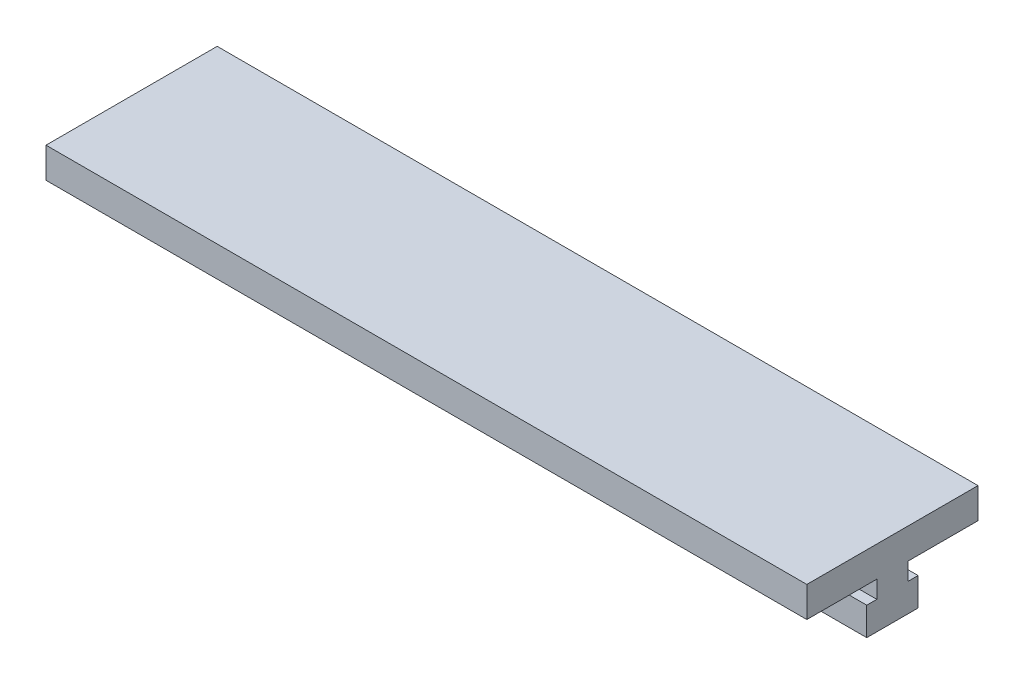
ISO-10303-21;
HEADER;
FILE_DESCRIPTION(('STEP AP214'),'2;1');
FILE_NAME('part.step','',(''),(''),'','','');
FILE_SCHEMA(('AUTOMOTIVE_DESIGN { 1 0 10303 214 1 1 1 1 }'));
ENDSEC;
DATA;
#1=APPLICATION_CONTEXT('core data for automotive mechanical design processes');
#2=APPLICATION_PROTOCOL_DEFINITION('international standard','automotive_design',2000,#1);
#3=PRODUCT_CONTEXT('',#1,'mechanical');
#4=PRODUCT('Part','Part','',(#3));
#5=PRODUCT_RELATED_PRODUCT_CATEGORY('part','',(#4));
#6=PRODUCT_DEFINITION_FORMATION('','',#4);
#7=PRODUCT_DEFINITION_CONTEXT('part definition',#1,'design');
#8=PRODUCT_DEFINITION('design','',#6,#7);
#9=PRODUCT_DEFINITION_SHAPE('','',#8);
#10=(LENGTH_UNIT() NAMED_UNIT(*) SI_UNIT(.MILLI.,.METRE.));
#11=(NAMED_UNIT(*) PLANE_ANGLE_UNIT() SI_UNIT($,.RADIAN.));
#12=(NAMED_UNIT(*) SI_UNIT($,.STERADIAN.) SOLID_ANGLE_UNIT());
#13=UNCERTAINTY_MEASURE_WITH_UNIT(LENGTH_MEASURE(1.E-05),#10,'distance_accuracy_value','');
#14=(GEOMETRIC_REPRESENTATION_CONTEXT(3) GLOBAL_UNCERTAINTY_ASSIGNED_CONTEXT((#13)) GLOBAL_UNIT_ASSIGNED_CONTEXT((#10,
#11,#12)) REPRESENTATION_CONTEXT('',''));
#15=CARTESIAN_POINT('',(0.,0.,0.));
#16=DIRECTION('',(0.,0.,1.));
#17=DIRECTION('',(1.,0.,0.));
#18=AXIS2_PLACEMENT_3D('',#15,#16,#17);
#19=CARTESIAN_POINT('',(200.,2.33209375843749,-22.632837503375));
#20=DIRECTION('',(0.,0.,1.));
#21=DIRECTION('',(1.,0.,0.));
#22=AXIS2_PLACEMENT_3D('',#19,#20,#21);
#23=PLANE('',#22);
#24=DIRECTION('',(0.,1.,0.));
#25=VECTOR('',#24,1.);
#26=CARTESIAN_POINT('',(0.,2.33209375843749,-22.632837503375));
#27=LINE('',#26,#25);
#28=CARTESIAN_POINT('',(0.,2.33209375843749,-22.632837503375));
#29=VERTEX_POINT('',#28);
#30=CARTESIAN_POINT('',(0.,10.3320937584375,-22.632837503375));
#31=VERTEX_POINT('',#30);
#32=EDGE_CURVE('E213',#29,#31,#27,.T.);
#33=ORIENTED_EDGE('',*,*,#32,.T.);
#34=DIRECTION('',(-1.,0.,0.));
#35=VECTOR('',#34,1.);
#36=CARTESIAN_POINT('',(200.,10.3320937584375,-22.632837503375));
#37=LINE('',#36,#35);
#38=CARTESIAN_POINT('',(200.,10.3320937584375,-22.632837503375));
#39=VERTEX_POINT('',#38);
#40=EDGE_CURVE('E13',#39,#31,#37,.T.);
#41=ORIENTED_EDGE('',*,*,#40,.F.);
#42=DIRECTION('',(0.,1.,0.));
#43=VECTOR('',#42,1.);
#44=CARTESIAN_POINT('',(200.,2.33209375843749,-22.632837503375));
#45=LINE('',#44,#43);
#46=CARTESIAN_POINT('',(200.,2.33209375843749,-22.632837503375));
#47=VERTEX_POINT('',#46);
#48=EDGE_CURVE('E247',#47,#39,#45,.T.);
#49=ORIENTED_EDGE('',*,*,#48,.F.);
#50=DIRECTION('',(-1.,0.,0.));
#51=VECTOR('',#50,1.);
#52=CARTESIAN_POINT('',(200.,2.33209375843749,-22.632837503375));
#53=LINE('',#52,#51);
#54=EDGE_CURVE('E209',#47,#29,#53,.T.);
#55=ORIENTED_EDGE('',*,*,#54,.T.);
#56=EDGE_LOOP('',(#33,#41,#49,#55));
#57=FACE_BOUND('',#56,.T.);
#58=ADVANCED_FACE('F88',(#57),#23,.F.);
#59=CARTESIAN_POINT('',(200.,10.3320937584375,-22.632837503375));
#60=DIRECTION('',(0.,-1.,0.));
#61=DIRECTION('',(0.,0.,-1.));
#62=AXIS2_PLACEMENT_3D('',#59,#60,#61);
#63=PLANE('',#62);
#64=DIRECTION('',(0.,0.,1.));
#65=VECTOR('',#64,1.);
#66=CARTESIAN_POINT('',(0.,10.3320937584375,-22.632837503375));
#67=LINE('',#66,#65);
#68=CARTESIAN_POINT('',(0.,10.3320937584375,22.367162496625));
#69=VERTEX_POINT('',#68);
#70=EDGE_CURVE('E217',#31,#69,#67,.T.);
#71=ORIENTED_EDGE('',*,*,#70,.T.);
#72=DIRECTION('',(-1.,0.,0.));
#73=VECTOR('',#72,1.);
#74=CARTESIAN_POINT('',(200.,10.3320937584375,22.367162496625));
#75=LINE('',#74,#73);
#76=CARTESIAN_POINT('',(200.,10.3320937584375,22.367162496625));
#77=VERTEX_POINT('',#76);
#78=EDGE_CURVE('E97',#77,#69,#75,.T.);
#79=ORIENTED_EDGE('',*,*,#78,.F.);
#80=DIRECTION('',(0.,0.,1.));
#81=VECTOR('',#80,1.);
#82=CARTESIAN_POINT('',(200.,10.3320937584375,-22.632837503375));
#83=LINE('',#82,#81);
#84=EDGE_CURVE('E160',#39,#77,#83,.T.);
#85=ORIENTED_EDGE('',*,*,#84,.F.);
#86=ORIENTED_EDGE('',*,*,#40,.T.);
#87=EDGE_LOOP('',(#71,#79,#85,#86));
#88=FACE_BOUND('',#87,.T.);
#89=ADVANCED_FACE('F341',(#88),#63,.F.);
#90=CARTESIAN_POINT('',(200.,10.3320937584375,22.367162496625));
#91=DIRECTION('',(0.,0.,-1.));
#92=DIRECTION('',(-1.,0.,0.));
#93=AXIS2_PLACEMENT_3D('',#90,#91,#92);
#94=PLANE('',#93);
#95=DIRECTION('',(0.,-1.,0.));
#96=VECTOR('',#95,1.);
#97=CARTESIAN_POINT('',(0.,10.3320937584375,22.367162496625));
#98=LINE('',#97,#96);
#99=CARTESIAN_POINT('',(0.,2.33209375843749,22.367162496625));
#100=VERTEX_POINT('',#99);
#101=EDGE_CURVE('E220',#69,#100,#98,.T.);
#102=ORIENTED_EDGE('',*,*,#101,.T.);
#103=DIRECTION('',(-1.,0.,0.));
#104=VECTOR('',#103,1.);
#105=CARTESIAN_POINT('',(200.,2.33209375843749,22.367162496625));
#106=LINE('',#105,#104);
#107=CARTESIAN_POINT('',(200.,2.33209375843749,22.367162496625));
#108=VERTEX_POINT('',#107);
#109=EDGE_CURVE('E274',#108,#100,#106,.T.);
#110=ORIENTED_EDGE('',*,*,#109,.F.);
#111=DIRECTION('',(0.,-1.,0.));
#112=VECTOR('',#111,1.);
#113=CARTESIAN_POINT('',(200.,10.3320937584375,22.367162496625));
#114=LINE('',#113,#112);
#115=EDGE_CURVE('E284',#77,#108,#114,.T.);
#116=ORIENTED_EDGE('',*,*,#115,.F.);
#117=ORIENTED_EDGE('',*,*,#78,.T.);
#118=EDGE_LOOP('',(#102,#110,#116,#117));
#119=FACE_BOUND('',#118,.T.);
#120=ADVANCED_FACE('F282',(#119),#94,.F.);
#121=CARTESIAN_POINT('',(200.,2.33209375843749,22.367162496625));
#122=DIRECTION('',(0.,1.,0.));
#123=DIRECTION('',(0.,0.,1.));
#124=AXIS2_PLACEMENT_3D('',#121,#122,#123);
#125=PLANE('',#124);
#126=DIRECTION('',(0.,0.,-1.));
#127=VECTOR('',#126,1.);
#128=CARTESIAN_POINT('',(0.,2.33209375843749,22.367162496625));
#129=LINE('',#128,#127);
#130=CARTESIAN_POINT('',(0.,2.33209375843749,3.96716859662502));
#131=VERTEX_POINT('',#130);
#132=EDGE_CURVE('E223',#100,#131,#129,.T.);
#133=ORIENTED_EDGE('',*,*,#132,.T.);
#134=DIRECTION('',(-1.,0.,0.));
#135=VECTOR('',#134,1.);
#136=CARTESIAN_POINT('',(200.,2.33209375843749,3.96716859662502));
#137=LINE('',#136,#135);
#138=CARTESIAN_POINT('',(200.,2.33209375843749,3.96716859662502));
#139=VERTEX_POINT('',#138);
#140=EDGE_CURVE('E270',#139,#131,#137,.T.);
#141=ORIENTED_EDGE('',*,*,#140,.F.);
#142=DIRECTION('',(0.,0.,-1.));
#143=VECTOR('',#142,1.);
#144=CARTESIAN_POINT('',(200.,2.33209375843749,22.367162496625));
#145=LINE('',#144,#143);
#146=EDGE_CURVE('E303',#108,#139,#145,.T.);
#147=ORIENTED_EDGE('',*,*,#146,.F.);
#148=ORIENTED_EDGE('',*,*,#109,.T.);
#149=EDGE_LOOP('',(#133,#141,#147,#148));
#150=FACE_BOUND('',#149,.T.);
#151=ADVANCED_FACE('F293',(#150),#125,.F.);
#152=CARTESIAN_POINT('',(200.,2.33209375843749,3.96716859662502));
#153=DIRECTION('',(0.,0.,-1.));
#154=DIRECTION('',(-1.,0.,0.));
#155=AXIS2_PLACEMENT_3D('',#152,#153,#154);
#156=PLANE('',#155);
#157=DIRECTION('',(0.,-1.,0.));
#158=VECTOR('',#157,1.);
#159=CARTESIAN_POINT('',(0.,2.33209375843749,3.96716859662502));
#160=LINE('',#159,#158);
#161=CARTESIAN_POINT('',(0.,-2.26790471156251,3.96716859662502));
#162=VERTEX_POINT('',#161);
#163=EDGE_CURVE('E226',#131,#162,#160,.T.);
#164=ORIENTED_EDGE('',*,*,#163,.T.);
#165=DIRECTION('',(-1.,0.,0.));
#166=VECTOR('',#165,1.);
#167=CARTESIAN_POINT('',(200.,-2.26790471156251,3.96716859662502));
#168=LINE('',#167,#166);
#169=CARTESIAN_POINT('',(200.,-2.26790471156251,3.96716859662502));
#170=VERTEX_POINT('',#169);
#171=EDGE_CURVE('E266',#170,#162,#168,.T.);
#172=ORIENTED_EDGE('',*,*,#171,.F.);
#173=DIRECTION('',(0.,-1.,0.));
#174=VECTOR('',#173,1.);
#175=CARTESIAN_POINT('',(200.,2.33209375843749,3.96716859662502));
#176=LINE('',#175,#174);
#177=EDGE_CURVE('E299',#139,#170,#176,.T.);
#178=ORIENTED_EDGE('',*,*,#177,.F.);
#179=ORIENTED_EDGE('',*,*,#140,.T.);
#180=EDGE_LOOP('',(#164,#172,#178,#179));
#181=FACE_BOUND('',#180,.T.);
#182=ADVANCED_FACE('F297',(#181),#156,.F.);
#183=CARTESIAN_POINT('',(200.,-2.26790471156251,3.96716859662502));
#184=DIRECTION('',(0.,-1.,0.));
#185=DIRECTION('',(0.,0.,-1.));
#186=AXIS2_PLACEMENT_3D('',#183,#184,#185);
#187=PLANE('',#186);
#188=DIRECTION('',(0.,0.,1.));
#189=VECTOR('',#188,1.);
#190=CARTESIAN_POINT('',(0.,-2.26790471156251,3.96716859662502));
#191=LINE('',#190,#189);
#192=CARTESIAN_POINT('',(0.,-2.26790471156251,6.61716249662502));
#193=VERTEX_POINT('',#192);
#194=EDGE_CURVE('E229',#162,#193,#191,.T.);
#195=ORIENTED_EDGE('',*,*,#194,.T.);
#196=DIRECTION('',(-1.,0.,0.));
#197=VECTOR('',#196,1.);
#198=CARTESIAN_POINT('',(200.,-2.26790471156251,6.61716249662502));
#199=LINE('',#198,#197);
#200=CARTESIAN_POINT('',(200.,-2.26790471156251,6.61716249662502));
#201=VERTEX_POINT('',#200);
#202=EDGE_CURVE('E262',#201,#193,#199,.T.);
#203=ORIENTED_EDGE('',*,*,#202,.F.);
#204=DIRECTION('',(0.,0.,1.));
#205=VECTOR('',#204,1.);
#206=CARTESIAN_POINT('',(200.,-2.26790471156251,3.96716859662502));
#207=LINE('',#206,#205);
#208=EDGE_CURVE('E302',#170,#201,#207,.T.);
#209=ORIENTED_EDGE('',*,*,#208,.F.);
#210=ORIENTED_EDGE('',*,*,#171,.T.);
#211=EDGE_LOOP('',(#195,#203,#209,#210));
#212=FACE_BOUND('',#211,.T.);
#213=ADVANCED_FACE('F354',(#212),#187,.F.);
#214=CARTESIAN_POINT('',(200.,-2.26790471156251,6.61716249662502));
#215=DIRECTION('',(0.,0.,-1.));
#216=DIRECTION('',(-1.,0.,0.));
#217=AXIS2_PLACEMENT_3D('',#214,#215,#216);
#218=PLANE('',#217);
#219=DIRECTION('',(0.,-1.,0.));
#220=VECTOR('',#219,1.);
#221=CARTESIAN_POINT('',(0.,-2.26790471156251,6.61716249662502));
#222=LINE('',#221,#220);
#223=CARTESIAN_POINT('',(0.,-9.66790624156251,6.61716249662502));
#224=VERTEX_POINT('',#223);
#225=EDGE_CURVE('E232',#193,#224,#222,.T.);
#226=ORIENTED_EDGE('',*,*,#225,.T.);
#227=DIRECTION('',(-1.,0.,0.));
#228=VECTOR('',#227,1.);
#229=CARTESIAN_POINT('',(200.,-9.66790624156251,6.61716249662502));
#230=LINE('',#229,#228);
#231=CARTESIAN_POINT('',(200.,-9.66790624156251,6.61716249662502));
#232=VERTEX_POINT('',#231);
#233=EDGE_CURVE('E258',#232,#224,#230,.T.);
#234=ORIENTED_EDGE('',*,*,#233,.F.);
#235=DIRECTION('',(0.,-1.,0.));
#236=VECTOR('',#235,1.);
#237=CARTESIAN_POINT('',(200.,-2.26790471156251,6.61716249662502));
#238=LINE('',#237,#236);
#239=EDGE_CURVE('E307',#201,#232,#238,.T.);
#240=ORIENTED_EDGE('',*,*,#239,.F.);
#241=ORIENTED_EDGE('',*,*,#202,.T.);
#242=EDGE_LOOP('',(#226,#234,#240,#241));
#243=FACE_BOUND('',#242,.T.);
#244=ADVANCED_FACE('F357',(#243),#218,.F.);
#245=CARTESIAN_POINT('',(200.,-9.66790624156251,6.61716249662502));
#246=DIRECTION('',(0.,1.,0.));
#247=DIRECTION('',(0.,0.,1.));
#248=AXIS2_PLACEMENT_3D('',#245,#246,#247);
#249=PLANE('',#248);
#250=DIRECTION('',(0.,0.,-1.));
#251=VECTOR('',#250,1.);
#252=CARTESIAN_POINT('',(0.,-9.66790624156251,6.61716249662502));
#253=LINE('',#252,#251);
#254=CARTESIAN_POINT('',(0.,-9.66790624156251,-6.88283750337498));
#255=VERTEX_POINT('',#254);
#256=EDGE_CURVE('E235',#224,#255,#253,.T.);
#257=ORIENTED_EDGE('',*,*,#256,.T.);
#258=DIRECTION('',(-1.,0.,0.));
#259=VECTOR('',#258,1.);
#260=CARTESIAN_POINT('',(200.,-9.66790624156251,-6.88283750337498));
#261=LINE('',#260,#259);
#262=CARTESIAN_POINT('',(200.,-9.66790624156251,-6.88283750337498));
#263=VERTEX_POINT('',#262);
#264=EDGE_CURVE('E254',#263,#255,#261,.T.);
#265=ORIENTED_EDGE('',*,*,#264,.F.);
#266=DIRECTION('',(0.,0.,-1.));
#267=VECTOR('',#266,1.);
#268=CARTESIAN_POINT('',(200.,-9.66790624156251,6.61716249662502));
#269=LINE('',#268,#267);
#270=EDGE_CURVE('E314',#232,#263,#269,.T.);
#271=ORIENTED_EDGE('',*,*,#270,.F.);
#272=ORIENTED_EDGE('',*,*,#233,.T.);
#273=EDGE_LOOP('',(#257,#265,#271,#272));
#274=FACE_BOUND('',#273,.T.);
#275=ADVANCED_FACE('F322',(#274),#249,.F.);
#276=CARTESIAN_POINT('',(200.,-9.66790624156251,-6.88283750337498));
#277=DIRECTION('',(0.,0.,1.));
#278=DIRECTION('',(1.,0.,0.));
#279=AXIS2_PLACEMENT_3D('',#276,#277,#278);
#280=PLANE('',#279);
#281=DIRECTION('',(0.,1.,0.));
#282=VECTOR('',#281,1.);
#283=CARTESIAN_POINT('',(0.,-9.66790624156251,-6.88283750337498));
#284=LINE('',#283,#282);
#285=CARTESIAN_POINT('',(0.,-2.26790471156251,-6.88283750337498));
#286=VERTEX_POINT('',#285);
#287=EDGE_CURVE('E238',#255,#286,#284,.T.);
#288=ORIENTED_EDGE('',*,*,#287,.T.);
#289=DIRECTION('',(-1.,0.,0.));
#290=VECTOR('',#289,1.);
#291=CARTESIAN_POINT('',(200.,-2.26790471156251,-6.88283750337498));
#292=LINE('',#291,#290);
#293=CARTESIAN_POINT('',(200.,-2.26790471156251,-6.88283750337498));
#294=VERTEX_POINT('',#293);
#295=EDGE_CURVE('E202',#294,#286,#292,.T.);
#296=ORIENTED_EDGE('',*,*,#295,.F.);
#297=DIRECTION('',(0.,1.,0.));
#298=VECTOR('',#297,1.);
#299=CARTESIAN_POINT('',(200.,-9.66790624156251,-6.88283750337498));
#300=LINE('',#299,#298);
#301=EDGE_CURVE('E191',#263,#294,#300,.T.);
#302=ORIENTED_EDGE('',*,*,#301,.F.);
#303=ORIENTED_EDGE('',*,*,#264,.T.);
#304=EDGE_LOOP('',(#288,#296,#302,#303));
#305=FACE_BOUND('',#304,.T.);
#306=ADVANCED_FACE('F326',(#305),#280,.F.);
#307=CARTESIAN_POINT('',(200.,-2.26790471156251,-6.88283750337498));
#308=DIRECTION('',(0.,-1.,0.));
#309=DIRECTION('',(0.,0.,-1.));
#310=AXIS2_PLACEMENT_3D('',#307,#308,#309);
#311=PLANE('',#310);
#312=DIRECTION('',(0.,0.,1.));
#313=VECTOR('',#312,1.);
#314=CARTESIAN_POINT('',(0.,-2.26790471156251,-6.88283750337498));
#315=LINE('',#314,#313);
#316=CARTESIAN_POINT('',(0.,-2.26790471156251,-4.23284360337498));
#317=VERTEX_POINT('',#316);
#318=EDGE_CURVE('E200',#286,#317,#315,.T.);
#319=ORIENTED_EDGE('',*,*,#318,.T.);
#320=DIRECTION('',(-1.,0.,0.));
#321=VECTOR('',#320,1.);
#322=CARTESIAN_POINT('',(200.,-2.26790471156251,-4.23284360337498));
#323=LINE('',#322,#321);
#324=CARTESIAN_POINT('',(200.,-2.26790471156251,-4.23284360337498));
#325=VERTEX_POINT('',#324);
#326=EDGE_CURVE('E197',#325,#317,#323,.T.);
#327=ORIENTED_EDGE('',*,*,#326,.F.);
#328=DIRECTION('',(0.,0.,1.));
#329=VECTOR('',#328,1.);
#330=CARTESIAN_POINT('',(200.,-2.26790471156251,-6.88283750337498));
#331=LINE('',#330,#329);
#332=EDGE_CURVE('E185',#294,#325,#331,.T.);
#333=ORIENTED_EDGE('',*,*,#332,.F.);
#334=ORIENTED_EDGE('',*,*,#295,.T.);
#335=EDGE_LOOP('',(#319,#327,#333,#334));
#336=FACE_BOUND('',#335,.T.);
#337=ADVANCED_FACE('F198',(#336),#311,.F.);
#338=CARTESIAN_POINT('',(200.,-2.26790471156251,-4.23284360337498));
#339=DIRECTION('',(0.,0.,1.));
#340=DIRECTION('',(1.,0.,0.));
#341=AXIS2_PLACEMENT_3D('',#338,#339,#340);
#342=PLANE('',#341);
#343=DIRECTION('',(0.,1.,0.));
#344=VECTOR('',#343,1.);
#345=CARTESIAN_POINT('',(0.,-2.26790471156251,-4.23284360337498));
#346=LINE('',#345,#344);
#347=CARTESIAN_POINT('',(0.,2.33209375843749,-4.23284360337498));
#348=VERTEX_POINT('',#347);
#349=EDGE_CURVE('E146',#317,#348,#346,.T.);
#350=ORIENTED_EDGE('',*,*,#349,.T.);
#351=DIRECTION('',(-1.,0.,0.));
#352=VECTOR('',#351,1.);
#353=CARTESIAN_POINT('',(200.,2.33209375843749,-4.23284360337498));
#354=LINE('',#353,#352);
#355=CARTESIAN_POINT('',(200.,2.33209375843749,-4.23284360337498));
#356=VERTEX_POINT('',#355);
#357=EDGE_CURVE('E203',#356,#348,#354,.T.);
#358=ORIENTED_EDGE('',*,*,#357,.F.);
#359=DIRECTION('',(0.,1.,0.));
#360=VECTOR('',#359,1.);
#361=CARTESIAN_POINT('',(200.,-2.26790471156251,-4.23284360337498));
#362=LINE('',#361,#360);
#363=EDGE_CURVE('E189',#325,#356,#362,.T.);
#364=ORIENTED_EDGE('',*,*,#363,.F.);
#365=ORIENTED_EDGE('',*,*,#326,.T.);
#366=EDGE_LOOP('',(#350,#358,#364,#365));
#367=FACE_BOUND('',#366,.T.);
#368=ADVANCED_FACE('F205',(#367),#342,.F.);
#369=CARTESIAN_POINT('',(200.,2.33209375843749,-4.23284360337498));
#370=DIRECTION('',(0.,1.,0.));
#371=DIRECTION('',(0.,0.,1.));
#372=AXIS2_PLACEMENT_3D('',#369,#370,#371);
#373=PLANE('',#372);
#374=DIRECTION('',(0.,0.,-1.));
#375=VECTOR('',#374,1.);
#376=CARTESIAN_POINT('',(0.,2.33209375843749,-4.23284360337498));
#377=LINE('',#376,#375);
#378=EDGE_CURVE('E152',#348,#29,#377,.T.);
#379=ORIENTED_EDGE('',*,*,#378,.T.);
#380=ORIENTED_EDGE('',*,*,#54,.F.);
#381=DIRECTION('',(0.,0.,-1.));
#382=VECTOR('',#381,1.);
#383=CARTESIAN_POINT('',(200.,2.33209375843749,-4.23284360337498));
#384=LINE('',#383,#382);
#385=EDGE_CURVE('E105',#356,#47,#384,.T.);
#386=ORIENTED_EDGE('',*,*,#385,.F.);
#387=ORIENTED_EDGE('',*,*,#357,.T.);
#388=EDGE_LOOP('',(#379,#380,#386,#387));
#389=FACE_BOUND('',#388,.T.);
#390=ADVANCED_FACE('F330',(#389),#373,.F.);
#391=CARTESIAN_POINT('',(200.,0.,0.));
#392=DIRECTION('',(1.,0.,0.));
#393=DIRECTION('',(0.,0.,-1.));
#394=AXIS2_PLACEMENT_3D('',#391,#392,#393);
#395=PLANE('',#394);
#396=ORIENTED_EDGE('',*,*,#48,.T.);
#397=ORIENTED_EDGE('',*,*,#84,.T.);
#398=ORIENTED_EDGE('',*,*,#115,.T.);
#399=ORIENTED_EDGE('',*,*,#146,.T.);
#400=ORIENTED_EDGE('',*,*,#177,.T.);
#401=ORIENTED_EDGE('',*,*,#208,.T.);
#402=ORIENTED_EDGE('',*,*,#239,.T.);
#403=ORIENTED_EDGE('',*,*,#270,.T.);
#404=ORIENTED_EDGE('',*,*,#301,.T.);
#405=ORIENTED_EDGE('',*,*,#332,.T.);
#406=ORIENTED_EDGE('',*,*,#363,.T.);
#407=ORIENTED_EDGE('',*,*,#385,.T.);
#408=EDGE_LOOP('',(#396,#397,#398,#399,#400,#401,#402,#403,#404,#405,#406,#407));
#409=FACE_BOUND('',#408,.T.);
#410=ADVANCED_FACE('F187',(#409),#395,.T.);
#411=CARTESIAN_POINT('',(0.,0.,0.));
#412=DIRECTION('',(1.,0.,0.));
#413=DIRECTION('',(0.,0.,-1.));
#414=AXIS2_PLACEMENT_3D('',#411,#412,#413);
#415=PLANE('',#414);
#416=ORIENTED_EDGE('',*,*,#32,.F.);
#417=ORIENTED_EDGE('',*,*,#378,.F.);
#418=ORIENTED_EDGE('',*,*,#349,.F.);
#419=ORIENTED_EDGE('',*,*,#318,.F.);
#420=ORIENTED_EDGE('',*,*,#287,.F.);
#421=ORIENTED_EDGE('',*,*,#256,.F.);
#422=ORIENTED_EDGE('',*,*,#225,.F.);
#423=ORIENTED_EDGE('',*,*,#194,.F.);
#424=ORIENTED_EDGE('',*,*,#163,.F.);
#425=ORIENTED_EDGE('',*,*,#132,.F.);
#426=ORIENTED_EDGE('',*,*,#101,.F.);
#427=ORIENTED_EDGE('',*,*,#70,.F.);
#428=EDGE_LOOP('',(#416,#417,#418,#419,#420,#421,#422,#423,#424,#425,#426,#427));
#429=FACE_BOUND('',#428,.T.);
#430=ADVANCED_FACE('F288',(#429),#415,.F.);
#431=CLOSED_SHELL('',(#58,#89,#120,#151,#182,#213,#244,#275,#306,#337,#368,#390,#410,#430));
#432=MANIFOLD_SOLID_BREP('B2',#431);
#433=ADVANCED_BREP_SHAPE_REPRESENTATION('',(#18,#432),#14);
#434=SHAPE_DEFINITION_REPRESENTATION(#9,#433);
ENDSEC;
END-ISO-10303-21;
